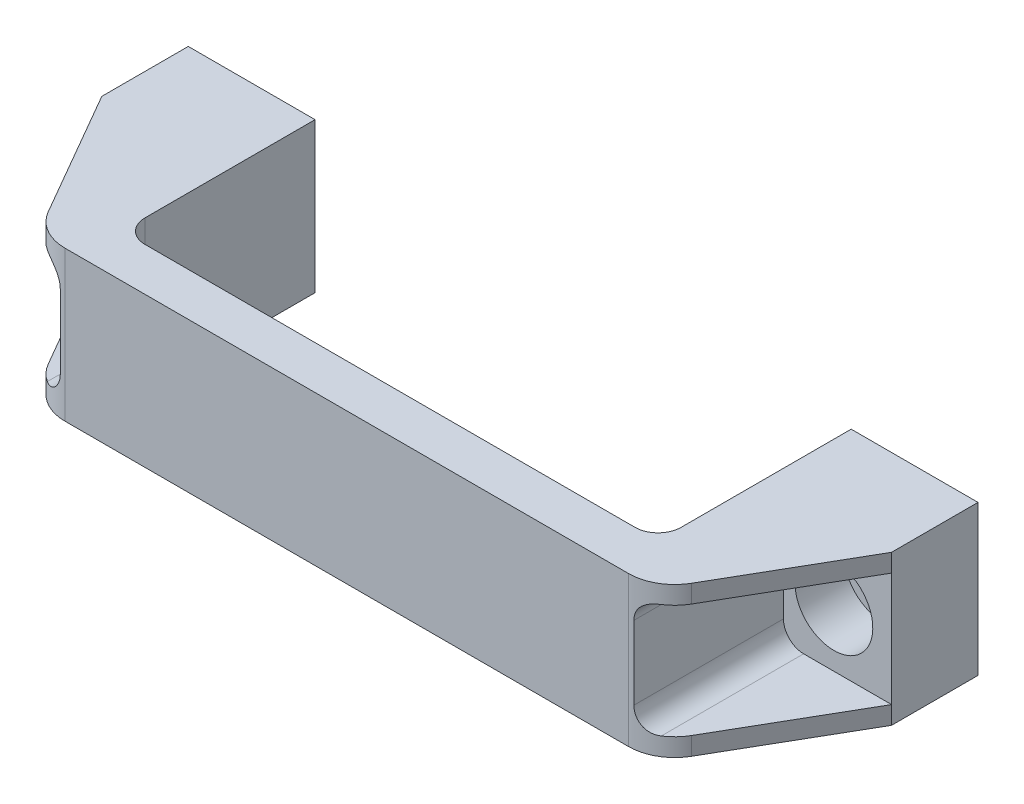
ISO-10303-21;
HEADER;
FILE_DESCRIPTION(('STEP AP214'),'2;1');
FILE_NAME('part.step','',(''),(''),'','','');
FILE_SCHEMA(('AUTOMOTIVE_DESIGN { 1 0 10303 214 1 1 1 1 }'));
ENDSEC;
DATA;
#1=APPLICATION_CONTEXT('core data for automotive mechanical design processes');
#2=APPLICATION_PROTOCOL_DEFINITION('international standard','automotive_design',2000,#1);
#3=PRODUCT_CONTEXT('',#1,'mechanical');
#4=PRODUCT('Part','Part','',(#3));
#5=PRODUCT_RELATED_PRODUCT_CATEGORY('part','',(#4));
#6=PRODUCT_DEFINITION_FORMATION('','',#4);
#7=PRODUCT_DEFINITION_CONTEXT('part definition',#1,'design');
#8=PRODUCT_DEFINITION('design','',#6,#7);
#9=PRODUCT_DEFINITION_SHAPE('','',#8);
#10=(LENGTH_UNIT() NAMED_UNIT(*) SI_UNIT(.MILLI.,.METRE.));
#11=(NAMED_UNIT(*) PLANE_ANGLE_UNIT() SI_UNIT($,.RADIAN.));
#12=(NAMED_UNIT(*) SI_UNIT($,.STERADIAN.) SOLID_ANGLE_UNIT());
#13=UNCERTAINTY_MEASURE_WITH_UNIT(LENGTH_MEASURE(1.E-05),#10,'distance_accuracy_value','');
#14=(GEOMETRIC_REPRESENTATION_CONTEXT(3) GLOBAL_UNCERTAINTY_ASSIGNED_CONTEXT((#13)) GLOBAL_UNIT_ASSIGNED_CONTEXT((#10,
#11,#12)) REPRESENTATION_CONTEXT('',''));
#15=CARTESIAN_POINT('',(0.,0.,0.));
#16=DIRECTION('',(0.,0.,1.));
#17=DIRECTION('',(1.,0.,0.));
#18=AXIS2_PLACEMENT_3D('',#15,#16,#17);
#19=CARTESIAN_POINT('',(0.,5.5,6.5));
#20=DIRECTION('',(0.,0.,-1.));
#21=DIRECTION('',(0.,1.,0.));
#22=AXIS2_PLACEMENT_3D('',#19,#20,#21);
#23=PLANE('',#22);
#24=CARTESIAN_POINT('',(0.,0.,6.5));
#25=DIRECTION('',(0.,0.,-1.));
#26=DIRECTION('',(0.,1.,0.));
#27=AXIS2_PLACEMENT_3D('',#24,#25,#26);
#28=CIRCLE('',#27,4.25);
#29=CARTESIAN_POINT('',(0.,4.25,6.5));
#30=VERTEX_POINT('',#29);
#31=EDGE_CURVE('E430',#30,#30,#28,.T.);
#32=ORIENTED_EDGE('',*,*,#31,.T.);
#33=EDGE_LOOP('',(#32));
#34=FACE_BOUND('',#33,.T.);
#35=CARTESIAN_POINT('',(0.,0.,6.5));
#36=DIRECTION('',(0.,0.,-1.));
#37=DIRECTION('',(0.,1.,0.));
#38=AXIS2_PLACEMENT_3D('',#35,#36,#37);
#39=CIRCLE('',#38,6.75);
#40=CARTESIAN_POINT('',(0.,6.75,6.5));
#41=VERTEX_POINT('',#40);
#42=EDGE_CURVE('E17',#41,#41,#39,.F.);
#43=ORIENTED_EDGE('',*,*,#42,.T.);
#44=EDGE_LOOP('',(#43));
#45=FACE_BOUND('',#44,.T.);
#46=ADVANCED_FACE('F14',(#34,#45),#23,.F.);
#47=CARTESIAN_POINT('',(117.,5.5,6.5));
#48=DIRECTION('',(0.,0.,-1.));
#49=DIRECTION('',(0.,1.,0.));
#50=AXIS2_PLACEMENT_3D('',#47,#48,#49);
#51=PLANE('',#50);
#52=CARTESIAN_POINT('',(117.,0.,6.5));
#53=DIRECTION('',(0.,0.,-1.));
#54=DIRECTION('',(0.,1.,0.));
#55=AXIS2_PLACEMENT_3D('',#52,#53,#54);
#56=CIRCLE('',#55,4.25);
#57=CARTESIAN_POINT('',(117.,4.25,6.5));
#58=VERTEX_POINT('',#57);
#59=EDGE_CURVE('E423',#58,#58,#56,.T.);
#60=ORIENTED_EDGE('',*,*,#59,.T.);
#61=EDGE_LOOP('',(#60));
#62=FACE_BOUND('',#61,.T.);
#63=CARTESIAN_POINT('',(117.,0.,6.5));
#64=DIRECTION('',(0.,0.,-1.));
#65=DIRECTION('',(0.,1.,0.));
#66=AXIS2_PLACEMENT_3D('',#63,#64,#65);
#67=CIRCLE('',#66,6.75);
#68=CARTESIAN_POINT('',(117.,6.75,6.5));
#69=VERTEX_POINT('',#68);
#70=EDGE_CURVE('E432',#69,#69,#67,.F.);
#71=ORIENTED_EDGE('',*,*,#70,.T.);
#72=EDGE_LOOP('',(#71));
#73=FACE_BOUND('',#72,.T.);
#74=ADVANCED_FACE('F443',(#62,#73),#51,.F.);
#75=CARTESIAN_POINT('',(0.,0.,10.75));
#76=DIRECTION('',(0.,0.,-1.));
#77=DIRECTION('',(0.,1.,0.));
#78=AXIS2_PLACEMENT_3D('',#75,#76,#77);
#79=CYLINDRICAL_SURFACE('',#78,6.75);
#80=CARTESIAN_POINT('',(0.,0.,15.));
#81=DIRECTION('',(0.,0.,-1.));
#82=DIRECTION('',(0.,1.,0.));
#83=AXIS2_PLACEMENT_3D('',#80,#81,#82);
#84=CIRCLE('',#83,6.75);
#85=CARTESIAN_POINT('',(0.,6.75,15.));
#86=VERTEX_POINT('',#85);
#87=EDGE_CURVE('E418',#86,#86,#84,.T.);
#88=ORIENTED_EDGE('',*,*,#87,.F.);
#89=EDGE_LOOP('',(#88));
#90=FACE_BOUND('',#89,.T.);
#91=ORIENTED_EDGE('',*,*,#42,.F.);
#92=EDGE_LOOP('',(#91));
#93=FACE_BOUND('',#92,.T.);
#94=ADVANCED_FACE('F440',(#90,#93),#79,.F.);
#95=CARTESIAN_POINT('',(117.,0.,10.75));
#96=DIRECTION('',(0.,0.,-1.));
#97=DIRECTION('',(0.,1.,0.));
#98=AXIS2_PLACEMENT_3D('',#95,#96,#97);
#99=CYLINDRICAL_SURFACE('',#98,6.75);
#100=CARTESIAN_POINT('',(117.,0.,15.));
#101=DIRECTION('',(0.,0.,-1.));
#102=DIRECTION('',(0.,1.,0.));
#103=AXIS2_PLACEMENT_3D('',#100,#101,#102);
#104=CIRCLE('',#103,6.75);
#105=CARTESIAN_POINT('',(117.,6.75,15.));
#106=VERTEX_POINT('',#105);
#107=EDGE_CURVE('E416',#106,#106,#104,.T.);
#108=ORIENTED_EDGE('',*,*,#107,.F.);
#109=EDGE_LOOP('',(#108));
#110=FACE_BOUND('',#109,.T.);
#111=ORIENTED_EDGE('',*,*,#70,.F.);
#112=EDGE_LOOP('',(#111));
#113=FACE_BOUND('',#112,.T.);
#114=ADVANCED_FACE('F442',(#110,#113),#99,.F.);
#115=CARTESIAN_POINT('',(0.,0.,3.25));
#116=DIRECTION('',(0.,0.,-1.));
#117=DIRECTION('',(0.,1.,0.));
#118=AXIS2_PLACEMENT_3D('',#115,#116,#117);
#119=CYLINDRICAL_SURFACE('',#118,4.25);
#120=CARTESIAN_POINT('',(0.,0.,0.));
#121=DIRECTION('',(0.,0.,-1.));
#122=DIRECTION('',(0.,1.,0.));
#123=AXIS2_PLACEMENT_3D('',#120,#121,#122);
#124=CIRCLE('',#123,4.25);
#125=CARTESIAN_POINT('',(0.,4.25,0.));
#126=VERTEX_POINT('',#125);
#127=EDGE_CURVE('E373',#126,#126,#124,.F.);
#128=ORIENTED_EDGE('',*,*,#127,.F.);
#129=EDGE_LOOP('',(#128));
#130=FACE_BOUND('',#129,.T.);
#131=ORIENTED_EDGE('',*,*,#31,.F.);
#132=EDGE_LOOP('',(#131));
#133=FACE_BOUND('',#132,.T.);
#134=ADVANCED_FACE('F450',(#130,#133),#119,.F.);
#135=CARTESIAN_POINT('',(117.,0.,3.25));
#136=DIRECTION('',(0.,0.,-1.));
#137=DIRECTION('',(0.,1.,0.));
#138=AXIS2_PLACEMENT_3D('',#135,#136,#137);
#139=CYLINDRICAL_SURFACE('',#138,4.25);
#140=CARTESIAN_POINT('',(117.,0.,0.));
#141=DIRECTION('',(0.,0.,-1.));
#142=DIRECTION('',(0.,1.,0.));
#143=AXIS2_PLACEMENT_3D('',#140,#141,#142);
#144=CIRCLE('',#143,4.25);
#145=CARTESIAN_POINT('',(117.,4.25,0.));
#146=VERTEX_POINT('',#145);
#147=EDGE_CURVE('E359',#146,#146,#144,.F.);
#148=ORIENTED_EDGE('',*,*,#147,.F.);
#149=EDGE_LOOP('',(#148));
#150=FACE_BOUND('',#149,.T.);
#151=ORIENTED_EDGE('',*,*,#59,.F.);
#152=EDGE_LOOP('',(#151));
#153=FACE_BOUND('',#152,.T.);
#154=ADVANCED_FACE('F458',(#150,#153),#139,.F.);
#155=CARTESIAN_POINT('',(58.5,0.,15.));
#156=DIRECTION('',(0.,0.,1.));
#157=DIRECTION('',(0.,-1.,0.));
#158=AXIS2_PLACEMENT_3D('',#155,#156,#157);
#159=PLANE('',#158);
#160=CARTESIAN_POINT('',(5.25,6.375,15.));
#161=DIRECTION('',(0.,0.,-1.));
#162=DIRECTION('',(0.,1.,0.));
#163=AXIS2_PLACEMENT_3D('',#160,#161,#162);
#164=CIRCLE('',#163,3.5);
#165=CARTESIAN_POINT('',(8.75,6.375,15.));
#166=VERTEX_POINT('',#165);
#167=CARTESIAN_POINT('',(5.25,9.875,15.));
#168=VERTEX_POINT('',#167);
#169=EDGE_CURVE('E142',#166,#168,#164,.F.);
#170=ORIENTED_EDGE('',*,*,#169,.T.);
#171=DIRECTION('',(-1.,0.,0.));
#172=VECTOR('',#171,1.);
#173=CARTESIAN_POINT('',(-12.,9.875,15.));
#174=LINE('',#173,#172);
#175=CARTESIAN_POINT('',(-10.,9.875,15.));
#176=VERTEX_POINT('',#175);
#177=EDGE_CURVE('E146',#168,#176,#174,.T.);
#178=ORIENTED_EDGE('',*,*,#177,.T.);
#179=DIRECTION('',(0.,-1.,0.));
#180=VECTOR('',#179,1.);
#181=CARTESIAN_POINT('',(-10.,-13.,15.));
#182=LINE('',#181,#180);
#183=CARTESIAN_POINT('',(-10.,-9.875,15.));
#184=VERTEX_POINT('',#183);
#185=EDGE_CURVE('E338',#184,#176,#182,.F.);
#186=ORIENTED_EDGE('',*,*,#185,.F.);
#187=DIRECTION('',(1.,0.,0.));
#188=VECTOR('',#187,1.);
#189=CARTESIAN_POINT('',(5.25,-9.875,15.));
#190=LINE('',#189,#188);
#191=CARTESIAN_POINT('',(5.25,-9.875,15.));
#192=VERTEX_POINT('',#191);
#193=EDGE_CURVE('E415',#184,#192,#190,.T.);
#194=ORIENTED_EDGE('',*,*,#193,.T.);
#195=CARTESIAN_POINT('',(5.25,-6.375,15.));
#196=DIRECTION('',(0.,0.,-1.));
#197=DIRECTION('',(0.,1.,0.));
#198=AXIS2_PLACEMENT_3D('',#195,#196,#197);
#199=CIRCLE('',#198,3.5);
#200=CARTESIAN_POINT('',(8.75,-6.375,15.));
#201=VERTEX_POINT('',#200);
#202=EDGE_CURVE('E380',#192,#201,#199,.F.);
#203=ORIENTED_EDGE('',*,*,#202,.T.);
#204=DIRECTION('',(0.,1.,0.));
#205=VECTOR('',#204,1.);
#206=CARTESIAN_POINT('',(8.75,6.375,15.));
#207=LINE('',#206,#205);
#208=EDGE_CURVE('E138',#201,#166,#207,.T.);
#209=ORIENTED_EDGE('',*,*,#208,.T.);
#210=EDGE_LOOP('',(#170,#178,#186,#194,#203,#209));
#211=FACE_BOUND('',#210,.T.);
#212=ORIENTED_EDGE('',*,*,#87,.T.);
#213=EDGE_LOOP('',(#212));
#214=FACE_BOUND('',#213,.T.);
#215=ADVANCED_FACE('F462',(#211,#214),#159,.T.);
#216=CARTESIAN_POINT('',(58.5,0.,15.));
#217=DIRECTION('',(0.,0.,1.));
#218=DIRECTION('',(0.,-1.,0.));
#219=AXIS2_PLACEMENT_3D('',#216,#217,#218);
#220=PLANE('',#219);
#221=CARTESIAN_POINT('',(111.75,-6.375,15.));
#222=DIRECTION('',(0.,0.,-1.));
#223=DIRECTION('',(0.,1.,0.));
#224=AXIS2_PLACEMENT_3D('',#221,#222,#223);
#225=CIRCLE('',#224,3.5);
#226=CARTESIAN_POINT('',(108.25,-6.375,15.));
#227=VERTEX_POINT('',#226);
#228=CARTESIAN_POINT('',(111.75,-9.875,15.));
#229=VERTEX_POINT('',#228);
#230=EDGE_CURVE('E180',#227,#229,#225,.F.);
#231=ORIENTED_EDGE('',*,*,#230,.T.);
#232=DIRECTION('',(1.,0.,0.));
#233=VECTOR('',#232,1.);
#234=CARTESIAN_POINT('',(129.,-9.875,15.));
#235=LINE('',#234,#233);
#236=CARTESIAN_POINT('',(127.,-9.875,15.));
#237=VERTEX_POINT('',#236);
#238=EDGE_CURVE('E176',#229,#237,#235,.T.);
#239=ORIENTED_EDGE('',*,*,#238,.T.);
#240=DIRECTION('',(0.,1.,0.));
#241=VECTOR('',#240,1.);
#242=CARTESIAN_POINT('',(127.,-13.,15.));
#243=LINE('',#242,#241);
#244=CARTESIAN_POINT('',(127.,9.875,15.));
#245=VERTEX_POINT('',#244);
#246=EDGE_CURVE('E353',#245,#237,#243,.F.);
#247=ORIENTED_EDGE('',*,*,#246,.F.);
#248=DIRECTION('',(-1.,0.,0.));
#249=VECTOR('',#248,1.);
#250=CARTESIAN_POINT('',(111.75,9.875,15.));
#251=LINE('',#250,#249);
#252=CARTESIAN_POINT('',(111.75,9.875,15.));
#253=VERTEX_POINT('',#252);
#254=EDGE_CURVE('E332',#245,#253,#251,.T.);
#255=ORIENTED_EDGE('',*,*,#254,.T.);
#256=CARTESIAN_POINT('',(111.75,6.375,15.));
#257=DIRECTION('',(0.,0.,-1.));
#258=DIRECTION('',(0.,1.,0.));
#259=AXIS2_PLACEMENT_3D('',#256,#257,#258);
#260=CIRCLE('',#259,3.5);
#261=CARTESIAN_POINT('',(108.25,6.375,15.));
#262=VERTEX_POINT('',#261);
#263=EDGE_CURVE('E320',#253,#262,#260,.F.);
#264=ORIENTED_EDGE('',*,*,#263,.T.);
#265=DIRECTION('',(0.,-1.,0.));
#266=VECTOR('',#265,1.);
#267=CARTESIAN_POINT('',(108.25,-6.375,15.));
#268=LINE('',#267,#266);
#269=EDGE_CURVE('E179',#262,#227,#268,.T.);
#270=ORIENTED_EDGE('',*,*,#269,.T.);
#271=EDGE_LOOP('',(#231,#239,#247,#255,#264,#270));
#272=FACE_BOUND('',#271,.T.);
#273=ORIENTED_EDGE('',*,*,#107,.T.);
#274=EDGE_LOOP('',(#273));
#275=FACE_BOUND('',#274,.T.);
#276=ADVANCED_FACE('F466',(#272,#275),#220,.T.);
#277=CARTESIAN_POINT('',(5.25,-9.875,15.));
#278=DIRECTION('',(0.,-1.,0.));
#279=DIRECTION('',(1.,0.,0.));
#280=AXIS2_PLACEMENT_3D('',#277,#278,#279);
#281=PLANE('',#280);
#282=DIRECTION('',(0.,0.,-1.));
#283=VECTOR('',#282,1.);
#284=CARTESIAN_POINT('',(5.25,-9.875,15.));
#285=LINE('',#284,#283);
#286=CARTESIAN_POINT('',(5.25,-9.875,39.6945048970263));
#287=VERTEX_POINT('',#286);
#288=EDGE_CURVE('E381',#287,#192,#285,.T.);
#289=ORIENTED_EDGE('',*,*,#288,.T.);
#290=ORIENTED_EDGE('',*,*,#193,.F.);
#291=DIRECTION('',(-0.5,0.,-0.866025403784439));
#292=VECTOR('',#291,1.);
#293=CARTESIAN_POINT('',(2.7017059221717,-9.875,37.));
#294=LINE('',#293,#292);
#295=CARTESIAN_POINT('',(2.70170592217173,-9.875,37.));
#296=VERTEX_POINT('',#295);
#297=EDGE_CURVE('E352',#296,#184,#294,.T.);
#298=ORIENTED_EDGE('',*,*,#297,.F.);
#299=CARTESIAN_POINT('',(9.6299091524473,-9.875,33.));
#300=DIRECTION('',(0.,-1.,0.));
#301=DIRECTION('',(1.,0.,0.));
#302=AXIS2_PLACEMENT_3D('',#299,#300,#301);
#303=CIRCLE('',#302,8.);
#304=EDGE_CURVE('E301',#287,#296,#303,.T.);
#305=ORIENTED_EDGE('',*,*,#304,.F.);
#306=EDGE_LOOP('',(#289,#290,#298,#305));
#307=FACE_BOUND('',#306,.T.);
#308=ADVANCED_FACE('F469',(#307),#281,.F.);
#309=CARTESIAN_POINT('',(2.7017059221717,-13.,37.));
#310=DIRECTION('',(-0.866025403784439,0.,0.5));
#311=DIRECTION('',(-0.5,0.,-0.866025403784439));
#312=AXIS2_PLACEMENT_3D('',#309,#310,#311);
#313=PLANE('',#312);
#314=DIRECTION('',(-0.5,0.,-0.86602540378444));
#315=VECTOR('',#314,1.);
#316=CARTESIAN_POINT('',(2.7017059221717,13.,37.));
#317=LINE('',#316,#315);
#318=CARTESIAN_POINT('',(2.70170592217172,13.,37.));
#319=VERTEX_POINT('',#318);
#320=CARTESIAN_POINT('',(-10.,13.,15.));
#321=VERTEX_POINT('',#320);
#322=EDGE_CURVE('E303',#319,#321,#317,.T.);
#323=ORIENTED_EDGE('',*,*,#322,.T.);
#324=DIRECTION('',(0.,-1.,0.));
#325=VECTOR('',#324,1.);
#326=CARTESIAN_POINT('',(-10.,-13.,15.));
#327=LINE('',#326,#325);
#328=EDGE_CURVE('E400',#176,#321,#327,.F.);
#329=ORIENTED_EDGE('',*,*,#328,.F.);
#330=DIRECTION('',(0.5,0.,0.86602540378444));
#331=VECTOR('',#330,1.);
#332=CARTESIAN_POINT('',(-10.,9.875,15.));
#333=LINE('',#332,#331);
#334=CARTESIAN_POINT('',(2.70170592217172,9.875,37.));
#335=VERTEX_POINT('',#334);
#336=EDGE_CURVE('E388',#176,#335,#333,.T.);
#337=ORIENTED_EDGE('',*,*,#336,.T.);
#338=DIRECTION('',(0.,-1.,0.));
#339=VECTOR('',#338,1.);
#340=CARTESIAN_POINT('',(2.70170592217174,-13.,37.));
#341=LINE('',#340,#339);
#342=EDGE_CURVE('E390',#319,#335,#341,.T.);
#343=ORIENTED_EDGE('',*,*,#342,.F.);
#344=EDGE_LOOP('',(#323,#329,#337,#343));
#345=FACE_BOUND('',#344,.T.);
#346=ADVANCED_FACE('F473',(#345),#313,.T.);
#347=CARTESIAN_POINT('',(-12.,9.875,15.));
#348=DIRECTION('',(0.,1.,0.));
#349=DIRECTION('',(-1.,0.,0.));
#350=AXIS2_PLACEMENT_3D('',#347,#348,#349);
#351=PLANE('',#350);
#352=ORIENTED_EDGE('',*,*,#177,.F.);
#353=DIRECTION('',(0.,0.,-1.));
#354=VECTOR('',#353,1.);
#355=CARTESIAN_POINT('',(5.25,9.875,15.));
#356=LINE('',#355,#354);
#357=CARTESIAN_POINT('',(5.25,9.875,39.6945048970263));
#358=VERTEX_POINT('',#357);
#359=EDGE_CURVE('E386',#168,#358,#356,.F.);
#360=ORIENTED_EDGE('',*,*,#359,.T.);
#361=CARTESIAN_POINT('',(9.6299091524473,9.875,33.));
#362=DIRECTION('',(0.,-1.,0.));
#363=DIRECTION('',(1.,0.,0.));
#364=AXIS2_PLACEMENT_3D('',#361,#362,#363);
#365=CIRCLE('',#364,8.);
#366=EDGE_CURVE('E393',#335,#358,#365,.F.);
#367=ORIENTED_EDGE('',*,*,#366,.F.);
#368=ORIENTED_EDGE('',*,*,#336,.F.);
#369=EDGE_LOOP('',(#352,#360,#367,#368));
#370=FACE_BOUND('',#369,.T.);
#371=ADVANCED_FACE('F477',(#370),#351,.F.);
#372=CARTESIAN_POINT('',(5.25,6.375,15.));
#373=DIRECTION('',(0.,0.,-1.));
#374=DIRECTION('',(0.,1.,0.));
#375=AXIS2_PLACEMENT_3D('',#372,#373,#374);
#376=CYLINDRICAL_SURFACE('',#375,3.5);
#377=ORIENTED_EDGE('',*,*,#359,.F.);
#378=ORIENTED_EDGE('',*,*,#169,.F.);
#379=DIRECTION('',(0.,0.,1.));
#380=VECTOR('',#379,1.);
#381=CARTESIAN_POINT('',(8.75,6.375,15.));
#382=LINE('',#381,#380);
#383=CARTESIAN_POINT('',(8.75,6.375,40.9514627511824));
#384=VERTEX_POINT('',#383);
#385=EDGE_CURVE('E384',#166,#384,#382,.T.);
#386=ORIENTED_EDGE('',*,*,#385,.T.);
#387=CARTESIAN_POINT('',(5.25,9.875,39.6945048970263));
#388=CARTESIAN_POINT('',(5.33728505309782,9.87500834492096,39.7516304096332));
#389=CARTESIAN_POINT('',(5.42573221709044,9.87173436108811,39.8070407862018));
#390=CARTESIAN_POINT('',(5.60438573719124,9.85816355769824,39.9141848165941));
#391=CARTESIAN_POINT('',(5.69459339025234,9.84786135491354,39.9659156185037));
#392=CARTESIAN_POINT('',(5.8763497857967,9.81973076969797,40.0655204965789));
#393=CARTESIAN_POINT('',(5.96790183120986,9.80187903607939,40.1133820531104));
#394=CARTESIAN_POINT('',(6.15124747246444,9.75828656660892,40.2048177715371));
#395=CARTESIAN_POINT('',(6.24304100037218,9.73254785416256,40.2483930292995));
#396=CARTESIAN_POINT('',(6.42646466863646,9.67276922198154,40.3313113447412));
#397=CARTESIAN_POINT('',(6.51809152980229,9.6386872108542,40.3706314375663));
#398=CARTESIAN_POINT('',(6.69969555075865,9.56217578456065,40.4446936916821));
#399=CARTESIAN_POINT('',(6.78967281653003,9.51974690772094,40.4794361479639));
#400=CARTESIAN_POINT('',(6.96674762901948,9.42668157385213,40.5442988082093));
#401=CARTESIAN_POINT('',(7.05385084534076,9.37606260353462,40.5744285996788));
#402=CARTESIAN_POINT('',(7.22432519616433,9.26676233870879,40.6302825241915));
#403=CARTESIAN_POINT('',(7.30769670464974,9.20808185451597,40.6560070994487));
#404=CARTESIAN_POINT('',(7.46251037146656,9.08857602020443,40.7011881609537));
#405=CARTESIAN_POINT('',(7.53435450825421,9.02840353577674,40.7209983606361));
#406=CARTESIAN_POINT('',(7.67343392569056,8.9020142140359,40.757407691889));
#407=CARTESIAN_POINT('',(7.74066769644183,8.83579541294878,40.7740057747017));
#408=CARTESIAN_POINT('',(7.86987709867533,8.69775263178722,40.8042740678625));
#409=CARTESIAN_POINT('',(7.93185131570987,8.62592715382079,40.8179434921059));
#410=CARTESIAN_POINT('',(8.04996612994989,8.47719557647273,40.8426666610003));
#411=CARTESIAN_POINT('',(8.10610454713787,8.40028759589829,40.8537194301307));
#412=CARTESIAN_POINT('',(8.26328969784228,8.16528818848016,40.883122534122));
#413=CARTESIAN_POINT('',(8.35529291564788,8.0005821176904,40.8981997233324));
#414=CARTESIAN_POINT('',(8.51169369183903,7.65828046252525,40.9218621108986));
#415=CARTESIAN_POINT('',(8.57609912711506,7.48068857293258,40.9304491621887));
#416=CARTESIAN_POINT('',(8.66697782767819,7.1486648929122,40.9419431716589));
#417=CARTESIAN_POINT('',(8.69807580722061,6.99551731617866,40.9455740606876));
#418=CARTESIAN_POINT('',(8.72920837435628,6.76383229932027,40.9491405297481));
#419=CARTESIAN_POINT('',(8.73700015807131,6.68628679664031,40.9500160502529));
#420=CARTESIAN_POINT('',(8.74739656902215,6.53083455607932,40.9511750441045));
#421=CARTESIAN_POINT('',(8.7500005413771,6.45292777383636,40.9514584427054));
#422=CARTESIAN_POINT('',(8.75,6.375,40.9514627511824));
#423=B_SPLINE_CURVE_WITH_KNOTS('',3,(#387,#388,#389,#390,#391,#392,#393,#394,#395,#396,#397,
#398,#399,#400,#401,#402,#403,#404,#405,#406,#407,#408,#409,#410,#411,#412,#413,#414,#415,#416,
#417,#418,#419,#420,#421,#422),.UNSPECIFIED.,.F.,.F.,(4,2,2,2,2,2,2,2,2,2,2,2,2,2,2,2,2,4),(0.,
0.312928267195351,0.626096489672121,0.940240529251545,1.25430404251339,1.56998587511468,
1.88564735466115,2.20064354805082,2.51560810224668,2.80261182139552,3.08970908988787,
3.37688332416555,3.6641644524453,4.22913557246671,4.79394533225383,5.26140160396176,
5.49506957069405,5.72876703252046),.UNSPECIFIED.);
#424=EDGE_CURVE('E238',#358,#384,#423,.T.);
#425=ORIENTED_EDGE('',*,*,#424,.F.);
#426=EDGE_LOOP('',(#377,#378,#386,#425));
#427=FACE_BOUND('',#426,.T.);
#428=ADVANCED_FACE('F480',(#427),#376,.F.);
#429=CARTESIAN_POINT('',(8.75,6.375,15.));
#430=DIRECTION('',(1.,0.,0.));
#431=DIRECTION('',(0.,1.,0.));
#432=AXIS2_PLACEMENT_3D('',#429,#430,#431);
#433=PLANE('',#432);
#434=ORIENTED_EDGE('',*,*,#385,.F.);
#435=ORIENTED_EDGE('',*,*,#208,.F.);
#436=DIRECTION('',(0.,0.,-1.));
#437=VECTOR('',#436,1.);
#438=CARTESIAN_POINT('',(8.75,-6.375,15.));
#439=LINE('',#438,#437);
#440=CARTESIAN_POINT('',(8.75,-6.375,40.9514627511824));
#441=VERTEX_POINT('',#440);
#442=EDGE_CURVE('E378',#201,#441,#439,.F.);
#443=ORIENTED_EDGE('',*,*,#442,.T.);
#444=DIRECTION('',(0.,-1.,0.));
#445=VECTOR('',#444,1.);
#446=CARTESIAN_POINT('',(8.75,-13.,40.9514627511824));
#447=LINE('',#446,#445);
#448=EDGE_CURVE('E237',#384,#441,#447,.T.);
#449=ORIENTED_EDGE('',*,*,#448,.F.);
#450=EDGE_LOOP('',(#434,#435,#443,#449));
#451=FACE_BOUND('',#450,.T.);
#452=ADVANCED_FACE('F484',(#451),#433,.F.);
#453=CARTESIAN_POINT('',(5.25,-6.375,15.));
#454=DIRECTION('',(0.,0.,-1.));
#455=DIRECTION('',(0.,1.,0.));
#456=AXIS2_PLACEMENT_3D('',#453,#454,#455);
#457=CYLINDRICAL_SURFACE('',#456,3.5);
#458=ORIENTED_EDGE('',*,*,#442,.F.);
#459=ORIENTED_EDGE('',*,*,#202,.F.);
#460=ORIENTED_EDGE('',*,*,#288,.F.);
#461=CARTESIAN_POINT('',(8.75,-6.375,40.9514627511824));
#462=CARTESIAN_POINT('',(8.75000951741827,-6.47230552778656,40.9514506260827));
#463=CARTESIAN_POINT('',(8.74594214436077,-6.56960722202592,40.9510133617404));
#464=CARTESIAN_POINT('',(8.72972674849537,-6.76352526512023,40.9492008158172));
#465=CARTESIAN_POINT('',(8.71757880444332,-6.86014162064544,40.9478255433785));
#466=CARTESIAN_POINT('',(8.68527827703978,-7.05199611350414,40.9440495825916));
#467=CARTESIAN_POINT('',(8.66512712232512,-7.14723449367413,40.9416490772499));
#468=CARTESIAN_POINT('',(8.61699173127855,-7.33564284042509,40.9356524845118));
#469=CARTESIAN_POINT('',(8.58900764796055,-7.42881284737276,40.93205642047));
#470=CARTESIAN_POINT('',(8.49353149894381,-7.7043656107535,40.9191441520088));
#471=CARTESIAN_POINT('',(8.41451087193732,-7.8828186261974,40.90770345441));
#472=CARTESIAN_POINT('',(8.22838038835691,-8.22350182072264,40.8768362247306));
#473=CARTESIAN_POINT('',(8.12127883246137,-8.38573677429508,40.8574120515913));
#474=CARTESIAN_POINT('',(7.88404273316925,-8.68762301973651,40.8080995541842));
#475=CARTESIAN_POINT('',(7.75418312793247,-8.82750952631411,40.7783323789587));
#476=CARTESIAN_POINT('',(7.47558860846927,-9.08284504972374,40.7058119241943));
#477=CARTESIAN_POINT('',(7.3268656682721,-9.1983094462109,40.6630668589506));
#478=CARTESIAN_POINT('',(7.02013134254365,-9.39982115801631,40.5640209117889));
#479=CARTESIAN_POINT('',(6.86241921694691,-9.48649431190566,40.5080610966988));
#480=CARTESIAN_POINT('',(6.5403623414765,-9.63326700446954,40.3813687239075));
#481=CARTESIAN_POINT('',(6.37600862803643,-9.69332922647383,40.3106156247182));
#482=CARTESIAN_POINT('',(6.13007131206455,-9.7636104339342,40.1943946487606));
#483=CARTESIAN_POINT('',(6.04862668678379,-9.78367981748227,40.1542146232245));
#484=CARTESIAN_POINT('',(5.88612847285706,-9.81770527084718,40.0705331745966));
#485=CARTESIAN_POINT('',(5.80507495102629,-9.83166033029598,40.0270312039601));
#486=CARTESIAN_POINT('',(5.64415346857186,-9.85368143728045,39.9370185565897));
#487=CARTESIAN_POINT('',(5.564282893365,-9.8617633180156,39.8905163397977));
#488=CARTESIAN_POINT('',(5.40597323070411,-9.87242304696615,39.7946273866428));
#489=CARTESIAN_POINT('',(5.32753339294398,-9.87500386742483,39.7452422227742));
#490=CARTESIAN_POINT('',(5.25,-9.875,39.6945048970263));
#491=B_SPLINE_CURVE_WITH_KNOTS('',3,(#461,#462,#463,#464,#465,#466,#467,#468,#469,#470,#471,
#472,#473,#474,#475,#476,#477,#478,#479,#480,#481,#482,#483,#484,#485,#486,#487,#488,#489,#490),
.UNSPECIFIED.,.F.,.F.,(4,2,2,2,2,2,2,2,2,2,2,2,2,2,4),(0.,0.291823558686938,0.583644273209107,
0.875412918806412,1.16717586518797,1.75061907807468,2.33389002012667,2.91054732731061,
3.48684040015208,4.04963135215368,4.61320903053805,4.89202041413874,5.17087785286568,
5.44898071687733,5.72693328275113),.UNSPECIFIED.);
#492=EDGE_CURVE('E227',#441,#287,#491,.T.);
#493=ORIENTED_EDGE('',*,*,#492,.F.);
#494=EDGE_LOOP('',(#458,#459,#460,#493));
#495=FACE_BOUND('',#494,.T.);
#496=ADVANCED_FACE('F245',(#495),#457,.F.);
#497=CARTESIAN_POINT('',(-10.,-13.,0.));
#498=DIRECTION('',(0.,0.,-1.));
#499=DIRECTION('',(0.,1.,0.));
#500=AXIS2_PLACEMENT_3D('',#497,#498,#499);
#501=PLANE('',#500);
#502=DIRECTION('',(1.,0.,0.));
#503=VECTOR('',#502,1.);
#504=CARTESIAN_POINT('',(58.5,-13.,0.));
#505=LINE('',#504,#503);
#506=CARTESIAN_POINT('',(-10.,-13.,0.));
#507=VERTEX_POINT('',#506);
#508=CARTESIAN_POINT('',(12.,-13.,0.));
#509=VERTEX_POINT('',#508);
#510=EDGE_CURVE('E236',#507,#509,#505,.T.);
#511=ORIENTED_EDGE('',*,*,#510,.F.);
#512=DIRECTION('',(0.,-1.,0.));
#513=VECTOR('',#512,1.);
#514=CARTESIAN_POINT('',(-10.,-13.,0.));
#515=LINE('',#514,#513);
#516=CARTESIAN_POINT('',(-10.,13.,0.));
#517=VERTEX_POINT('',#516);
#518=EDGE_CURVE('E339',#517,#507,#515,.T.);
#519=ORIENTED_EDGE('',*,*,#518,.F.);
#520=DIRECTION('',(1.,0.,0.));
#521=VECTOR('',#520,1.);
#522=CARTESIAN_POINT('',(58.5,13.,0.));
#523=LINE('',#522,#521);
#524=CARTESIAN_POINT('',(12.,13.,0.));
#525=VERTEX_POINT('',#524);
#526=EDGE_CURVE('E302',#517,#525,#523,.T.);
#527=ORIENTED_EDGE('',*,*,#526,.T.);
#528=DIRECTION('',(0.,1.,0.));
#529=VECTOR('',#528,1.);
#530=CARTESIAN_POINT('',(12.,-13.,0.));
#531=LINE('',#530,#529);
#532=EDGE_CURVE('E370',#509,#525,#531,.T.);
#533=ORIENTED_EDGE('',*,*,#532,.F.);
#534=EDGE_LOOP('',(#511,#519,#527,#533));
#535=FACE_BOUND('',#534,.T.);
#536=ORIENTED_EDGE('',*,*,#127,.T.);
#537=EDGE_LOOP('',(#536));
#538=FACE_BOUND('',#537,.T.);
#539=ADVANCED_FACE('F491',(#535,#538),#501,.T.);
#540=CARTESIAN_POINT('',(12.,-13.,0.));
#541=DIRECTION('',(1.,0.,0.));
#542=DIRECTION('',(0.,1.,0.));
#543=AXIS2_PLACEMENT_3D('',#540,#541,#542);
#544=PLANE('',#543);
#545=DIRECTION('',(0.,0.,1.));
#546=VECTOR('',#545,1.);
#547=CARTESIAN_POINT('',(12.,-13.,0.));
#548=LINE('',#547,#546);
#549=CARTESIAN_POINT('',(12.,-13.,29.5));
#550=VERTEX_POINT('',#549);
#551=EDGE_CURVE('E226',#509,#550,#548,.T.);
#552=ORIENTED_EDGE('',*,*,#551,.F.);
#553=ORIENTED_EDGE('',*,*,#532,.T.);
#554=DIRECTION('',(0.,0.,1.));
#555=VECTOR('',#554,1.);
#556=CARTESIAN_POINT('',(12.,13.,0.));
#557=LINE('',#556,#555);
#558=CARTESIAN_POINT('',(12.,13.,29.5));
#559=VERTEX_POINT('',#558);
#560=EDGE_CURVE('E298',#525,#559,#557,.T.);
#561=ORIENTED_EDGE('',*,*,#560,.T.);
#562=DIRECTION('',(0.,-1.,0.));
#563=VECTOR('',#562,1.);
#564=CARTESIAN_POINT('',(12.,-13.,29.5));
#565=LINE('',#564,#563);
#566=EDGE_CURVE('E368',#559,#550,#565,.T.);
#567=ORIENTED_EDGE('',*,*,#566,.T.);
#568=EDGE_LOOP('',(#552,#553,#561,#567));
#569=FACE_BOUND('',#568,.T.);
#570=ADVANCED_FACE('F523',(#569),#544,.T.);
#571=CARTESIAN_POINT('',(16.,-13.,29.5));
#572=DIRECTION('',(0.,-1.,0.));
#573=DIRECTION('',(1.,0.,0.));
#574=AXIS2_PLACEMENT_3D('',#571,#572,#573);
#575=CYLINDRICAL_SURFACE('',#574,4.);
#576=DIRECTION('',(0.,1.,0.));
#577=VECTOR('',#576,1.);
#578=CARTESIAN_POINT('',(16.,-13.,33.5));
#579=LINE('',#578,#577);
#580=CARTESIAN_POINT('',(16.,-13.,33.5));
#581=VERTEX_POINT('',#580);
#582=CARTESIAN_POINT('',(16.,13.,33.5));
#583=VERTEX_POINT('',#582);
#584=EDGE_CURVE('E365',#581,#583,#579,.T.);
#585=ORIENTED_EDGE('',*,*,#584,.F.);
#586=CARTESIAN_POINT('',(16.,-13.,29.5));
#587=DIRECTION('',(0.,-1.,0.));
#588=DIRECTION('',(1.,0.,0.));
#589=AXIS2_PLACEMENT_3D('',#586,#587,#588);
#590=CIRCLE('',#589,4.);
#591=EDGE_CURVE('E223',#550,#581,#590,.F.);
#592=ORIENTED_EDGE('',*,*,#591,.F.);
#593=ORIENTED_EDGE('',*,*,#566,.F.);
#594=CARTESIAN_POINT('',(16.,13.,29.5));
#595=DIRECTION('',(0.,-1.,0.));
#596=DIRECTION('',(1.,0.,0.));
#597=AXIS2_PLACEMENT_3D('',#594,#595,#596);
#598=CIRCLE('',#597,4.);
#599=EDGE_CURVE('E317',#559,#583,#598,.F.);
#600=ORIENTED_EDGE('',*,*,#599,.T.);
#601=EDGE_LOOP('',(#585,#592,#593,#600));
#602=FACE_BOUND('',#601,.T.);
#603=ADVANCED_FACE('F596',(#602),#575,.F.);
#604=CARTESIAN_POINT('',(16.,-13.,33.5));
#605=DIRECTION('',(0.,0.,-1.));
#606=DIRECTION('',(0.,1.,0.));
#607=AXIS2_PLACEMENT_3D('',#604,#605,#606);
#608=PLANE('',#607);
#609=DIRECTION('',(1.,0.,0.));
#610=VECTOR('',#609,1.);
#611=CARTESIAN_POINT('',(58.5,-13.,33.5));
#612=LINE('',#611,#610);
#613=CARTESIAN_POINT('',(101.,-13.,33.5));
#614=VERTEX_POINT('',#613);
#615=EDGE_CURVE('E222',#581,#614,#612,.T.);
#616=ORIENTED_EDGE('',*,*,#615,.F.);
#617=ORIENTED_EDGE('',*,*,#584,.T.);
#618=DIRECTION('',(1.,0.,0.));
#619=VECTOR('',#618,1.);
#620=CARTESIAN_POINT('',(58.5,13.,33.5));
#621=LINE('',#620,#619);
#622=CARTESIAN_POINT('',(101.,13.,33.5));
#623=VERTEX_POINT('',#622);
#624=EDGE_CURVE('E315',#583,#623,#621,.T.);
#625=ORIENTED_EDGE('',*,*,#624,.T.);
#626=DIRECTION('',(0.,-1.,0.));
#627=VECTOR('',#626,1.);
#628=CARTESIAN_POINT('',(101.,-13.,33.5));
#629=LINE('',#628,#627);
#630=EDGE_CURVE('E363',#623,#614,#629,.T.);
#631=ORIENTED_EDGE('',*,*,#630,.T.);
#632=EDGE_LOOP('',(#616,#617,#625,#631));
#633=FACE_BOUND('',#632,.T.);
#634=ADVANCED_FACE('F544',(#633),#608,.T.);
#635=CARTESIAN_POINT('',(101.,-13.,29.5));
#636=DIRECTION('',(0.,-1.,0.));
#637=DIRECTION('',(1.,0.,0.));
#638=AXIS2_PLACEMENT_3D('',#635,#636,#637);
#639=CYLINDRICAL_SURFACE('',#638,4.);
#640=DIRECTION('',(0.,-1.,0.));
#641=VECTOR('',#640,1.);
#642=CARTESIAN_POINT('',(105.,-13.,29.5));
#643=LINE('',#642,#641);
#644=CARTESIAN_POINT('',(105.,-13.,29.5));
#645=VERTEX_POINT('',#644);
#646=CARTESIAN_POINT('',(105.,13.,29.5));
#647=VERTEX_POINT('',#646);
#648=EDGE_CURVE('E360',#645,#647,#643,.F.);
#649=ORIENTED_EDGE('',*,*,#648,.F.);
#650=CARTESIAN_POINT('',(101.,-13.,29.5));
#651=DIRECTION('',(0.,-1.,0.));
#652=DIRECTION('',(1.,0.,0.));
#653=AXIS2_PLACEMENT_3D('',#650,#651,#652);
#654=CIRCLE('',#653,4.);
#655=EDGE_CURVE('E218',#614,#645,#654,.F.);
#656=ORIENTED_EDGE('',*,*,#655,.F.);
#657=ORIENTED_EDGE('',*,*,#630,.F.);
#658=CARTESIAN_POINT('',(101.,13.,29.5));
#659=DIRECTION('',(0.,-1.,0.));
#660=DIRECTION('',(1.,0.,0.));
#661=AXIS2_PLACEMENT_3D('',#658,#659,#660);
#662=CIRCLE('',#661,4.);
#663=EDGE_CURVE('E314',#623,#647,#662,.F.);
#664=ORIENTED_EDGE('',*,*,#663,.T.);
#665=EDGE_LOOP('',(#649,#656,#657,#664));
#666=FACE_BOUND('',#665,.T.);
#667=ADVANCED_FACE('F549',(#666),#639,.F.);
#668=CARTESIAN_POINT('',(105.,-13.,29.5));
#669=DIRECTION('',(-1.,0.,0.));
#670=DIRECTION('',(0.,-1.,0.));
#671=AXIS2_PLACEMENT_3D('',#668,#669,#670);
#672=PLANE('',#671);
#673=DIRECTION('',(0.,0.,1.));
#674=VECTOR('',#673,1.);
#675=CARTESIAN_POINT('',(105.,-13.,0.));
#676=LINE('',#675,#674);
#677=CARTESIAN_POINT('',(105.,-13.,0.));
#678=VERTEX_POINT('',#677);
#679=EDGE_CURVE('E221',#645,#678,#676,.F.);
#680=ORIENTED_EDGE('',*,*,#679,.F.);
#681=ORIENTED_EDGE('',*,*,#648,.T.);
#682=DIRECTION('',(0.,0.,1.));
#683=VECTOR('',#682,1.);
#684=CARTESIAN_POINT('',(105.,13.,0.));
#685=LINE('',#684,#683);
#686=CARTESIAN_POINT('',(105.,13.,0.));
#687=VERTEX_POINT('',#686);
#688=EDGE_CURVE('E310',#647,#687,#685,.F.);
#689=ORIENTED_EDGE('',*,*,#688,.T.);
#690=DIRECTION('',(0.,1.,0.));
#691=VECTOR('',#690,1.);
#692=CARTESIAN_POINT('',(105.,-13.,0.));
#693=LINE('',#692,#691);
#694=EDGE_CURVE('E356',#678,#687,#693,.T.);
#695=ORIENTED_EDGE('',*,*,#694,.F.);
#696=EDGE_LOOP('',(#680,#681,#689,#695));
#697=FACE_BOUND('',#696,.T.);
#698=ADVANCED_FACE('F554',(#697),#672,.T.);
#699=CARTESIAN_POINT('',(105.,-13.,0.));
#700=DIRECTION('',(0.,0.,-1.));
#701=DIRECTION('',(0.,1.,0.));
#702=AXIS2_PLACEMENT_3D('',#699,#700,#701);
#703=PLANE('',#702);
#704=DIRECTION('',(1.,0.,0.));
#705=VECTOR('',#704,1.);
#706=CARTESIAN_POINT('',(58.5,-13.,0.));
#707=LINE('',#706,#705);
#708=CARTESIAN_POINT('',(127.,-13.,0.));
#709=VERTEX_POINT('',#708);
#710=EDGE_CURVE('E348',#678,#709,#707,.T.);
#711=ORIENTED_EDGE('',*,*,#710,.F.);
#712=ORIENTED_EDGE('',*,*,#694,.T.);
#713=DIRECTION('',(1.,0.,0.));
#714=VECTOR('',#713,1.);
#715=CARTESIAN_POINT('',(58.5,13.,0.));
#716=LINE('',#715,#714);
#717=CARTESIAN_POINT('',(127.,13.,0.));
#718=VERTEX_POINT('',#717);
#719=EDGE_CURVE('E313',#687,#718,#716,.T.);
#720=ORIENTED_EDGE('',*,*,#719,.T.);
#721=DIRECTION('',(0.,1.,0.));
#722=VECTOR('',#721,1.);
#723=CARTESIAN_POINT('',(127.,-13.,0.));
#724=LINE('',#723,#722);
#725=EDGE_CURVE('E349',#709,#718,#724,.T.);
#726=ORIENTED_EDGE('',*,*,#725,.F.);
#727=EDGE_LOOP('',(#711,#712,#720,#726));
#728=FACE_BOUND('',#727,.T.);
#729=ORIENTED_EDGE('',*,*,#147,.T.);
#730=EDGE_LOOP('',(#729));
#731=FACE_BOUND('',#730,.T.);
#732=ADVANCED_FACE('F599',(#728,#731),#703,.T.);
#733=CARTESIAN_POINT('',(127.,-13.,0.));
#734=DIRECTION('',(1.,0.,0.));
#735=DIRECTION('',(0.,1.,0.));
#736=AXIS2_PLACEMENT_3D('',#733,#734,#735);
#737=PLANE('',#736);
#738=DIRECTION('',(0.,0.,1.));
#739=VECTOR('',#738,1.);
#740=CARTESIAN_POINT('',(127.,-13.,0.));
#741=LINE('',#740,#739);
#742=CARTESIAN_POINT('',(127.,-13.,15.));
#743=VERTEX_POINT('',#742);
#744=EDGE_CURVE('E345',#709,#743,#741,.T.);
#745=ORIENTED_EDGE('',*,*,#744,.F.);
#746=ORIENTED_EDGE('',*,*,#725,.T.);
#747=DIRECTION('',(0.,0.,1.));
#748=VECTOR('',#747,1.);
#749=CARTESIAN_POINT('',(127.,13.,0.));
#750=LINE('',#749,#748);
#751=CARTESIAN_POINT('',(127.,13.,15.));
#752=VERTEX_POINT('',#751);
#753=EDGE_CURVE('E309',#718,#752,#750,.T.);
#754=ORIENTED_EDGE('',*,*,#753,.T.);
#755=DIRECTION('',(0.,-1.,0.));
#756=VECTOR('',#755,1.);
#757=CARTESIAN_POINT('',(127.,-13.,15.));
#758=LINE('',#757,#756);
#759=EDGE_CURVE('E331',#245,#752,#758,.F.);
#760=ORIENTED_EDGE('',*,*,#759,.F.);
#761=ORIENTED_EDGE('',*,*,#246,.T.);
#762=DIRECTION('',(0.,-1.,0.));
#763=VECTOR('',#762,1.);
#764=CARTESIAN_POINT('',(127.,-13.,15.));
#765=LINE('',#764,#763);
#766=EDGE_CURVE('E343',#743,#237,#765,.F.);
#767=ORIENTED_EDGE('',*,*,#766,.F.);
#768=EDGE_LOOP('',(#745,#746,#754,#760,#761,#767));
#769=FACE_BOUND('',#768,.T.);
#770=ADVANCED_FACE('F572',(#769),#737,.T.);
#771=CARTESIAN_POINT('',(2.7017059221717,-13.,37.));
#772=DIRECTION('',(-0.866025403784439,0.,0.5));
#773=DIRECTION('',(-0.5,0.,-0.866025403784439));
#774=AXIS2_PLACEMENT_3D('',#771,#772,#773);
#775=PLANE('',#774);
#776=DIRECTION('',(-0.5,0.,-0.86602540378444));
#777=VECTOR('',#776,1.);
#778=CARTESIAN_POINT('',(2.7017059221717,-13.,37.));
#779=LINE('',#778,#777);
#780=CARTESIAN_POINT('',(2.70170592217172,-13.,37.));
#781=VERTEX_POINT('',#780);
#782=CARTESIAN_POINT('',(-10.,-13.,15.));
#783=VERTEX_POINT('',#782);
#784=EDGE_CURVE('E216',#781,#783,#779,.T.);
#785=ORIENTED_EDGE('',*,*,#784,.F.);
#786=DIRECTION('',(0.,-1.,0.));
#787=VECTOR('',#786,1.);
#788=CARTESIAN_POINT('',(2.70170592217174,-13.,37.));
#789=LINE('',#788,#787);
#790=EDGE_CURVE('E340',#296,#781,#789,.T.);
#791=ORIENTED_EDGE('',*,*,#790,.F.);
#792=ORIENTED_EDGE('',*,*,#297,.T.);
#793=DIRECTION('',(0.,-1.,0.));
#794=VECTOR('',#793,1.);
#795=CARTESIAN_POINT('',(-10.,-13.,15.));
#796=LINE('',#795,#794);
#797=EDGE_CURVE('E335',#783,#184,#796,.F.);
#798=ORIENTED_EDGE('',*,*,#797,.F.);
#799=EDGE_LOOP('',(#785,#791,#792,#798));
#800=FACE_BOUND('',#799,.T.);
#801=ADVANCED_FACE('F581',(#800),#775,.T.);
#802=CARTESIAN_POINT('',(-10.,-13.,15.));
#803=DIRECTION('',(-1.,0.,0.));
#804=DIRECTION('',(0.,-1.,0.));
#805=AXIS2_PLACEMENT_3D('',#802,#803,#804);
#806=PLANE('',#805);
#807=ORIENTED_EDGE('',*,*,#185,.T.);
#808=ORIENTED_EDGE('',*,*,#328,.T.);
#809=DIRECTION('',(0.,0.,1.));
#810=VECTOR('',#809,1.);
#811=CARTESIAN_POINT('',(-10.,13.,0.));
#812=LINE('',#811,#810);
#813=EDGE_CURVE('E306',#321,#517,#812,.F.);
#814=ORIENTED_EDGE('',*,*,#813,.T.);
#815=ORIENTED_EDGE('',*,*,#518,.T.);
#816=DIRECTION('',(0.,0.,1.));
#817=VECTOR('',#816,1.);
#818=CARTESIAN_POINT('',(-10.,-13.,0.));
#819=LINE('',#818,#817);
#820=EDGE_CURVE('E212',#783,#507,#819,.F.);
#821=ORIENTED_EDGE('',*,*,#820,.F.);
#822=ORIENTED_EDGE('',*,*,#797,.T.);
#823=EDGE_LOOP('',(#807,#808,#814,#815,#821,#822));
#824=FACE_BOUND('',#823,.T.);
#825=ADVANCED_FACE('F508',(#824),#806,.T.);
#826=CARTESIAN_POINT('',(111.75,9.875,15.));
#827=DIRECTION('',(0.,1.,0.));
#828=DIRECTION('',(-1.,0.,0.));
#829=AXIS2_PLACEMENT_3D('',#826,#827,#828);
#830=PLANE('',#829);
#831=DIRECTION('',(0.,0.,-1.));
#832=VECTOR('',#831,1.);
#833=CARTESIAN_POINT('',(111.75,9.875,15.));
#834=LINE('',#833,#832);
#835=CARTESIAN_POINT('',(111.75,9.875,39.6945048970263));
#836=VERTEX_POINT('',#835);
#837=EDGE_CURVE('E321',#836,#253,#834,.T.);
#838=ORIENTED_EDGE('',*,*,#837,.T.);
#839=ORIENTED_EDGE('',*,*,#254,.F.);
#840=DIRECTION('',(-0.5,0.,0.866025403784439));
#841=VECTOR('',#840,1.);
#842=CARTESIAN_POINT('',(127.,9.875,15.));
#843=LINE('',#842,#841);
#844=CARTESIAN_POINT('',(114.298294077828,9.875,37.));
#845=VERTEX_POINT('',#844);
#846=EDGE_CURVE('E328',#845,#245,#843,.F.);
#847=ORIENTED_EDGE('',*,*,#846,.F.);
#848=CARTESIAN_POINT('',(107.370090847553,9.875,33.));
#849=DIRECTION('',(0.,-1.,0.));
#850=DIRECTION('',(1.,0.,0.));
#851=AXIS2_PLACEMENT_3D('',#848,#849,#850);
#852=CIRCLE('',#851,8.);
#853=EDGE_CURVE('E209',#836,#845,#852,.F.);
#854=ORIENTED_EDGE('',*,*,#853,.F.);
#855=EDGE_LOOP('',(#838,#839,#847,#854));
#856=FACE_BOUND('',#855,.T.);
#857=ADVANCED_FACE('F605',(#856),#830,.F.);
#858=CARTESIAN_POINT('',(127.,-13.,15.));
#859=DIRECTION('',(0.866025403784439,0.,0.5));
#860=DIRECTION('',(-0.5,0.,0.866025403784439));
#861=AXIS2_PLACEMENT_3D('',#858,#859,#860);
#862=PLANE('',#861);
#863=DIRECTION('',(-0.5,0.,0.866025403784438));
#864=VECTOR('',#863,1.);
#865=CARTESIAN_POINT('',(127.,13.,15.));
#866=LINE('',#865,#864);
#867=CARTESIAN_POINT('',(114.298294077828,13.,37.));
#868=VERTEX_POINT('',#867);
#869=EDGE_CURVE('E307',#752,#868,#866,.T.);
#870=ORIENTED_EDGE('',*,*,#869,.T.);
#871=DIRECTION('',(0.,-1.,0.));
#872=VECTOR('',#871,1.);
#873=CARTESIAN_POINT('',(114.298294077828,-13.,37.));
#874=LINE('',#873,#872);
#875=EDGE_CURVE('E208',#845,#868,#874,.F.);
#876=ORIENTED_EDGE('',*,*,#875,.F.);
#877=ORIENTED_EDGE('',*,*,#846,.T.);
#878=ORIENTED_EDGE('',*,*,#759,.T.);
#879=EDGE_LOOP('',(#870,#876,#877,#878));
#880=FACE_BOUND('',#879,.T.);
#881=ADVANCED_FACE('F602',(#880),#862,.T.);
#882=CARTESIAN_POINT('',(127.,-13.,15.));
#883=DIRECTION('',(0.866025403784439,0.,0.5));
#884=DIRECTION('',(-0.5,0.,0.866025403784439));
#885=AXIS2_PLACEMENT_3D('',#882,#883,#884);
#886=PLANE('',#885);
#887=DIRECTION('',(-0.5,0.,0.866025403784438));
#888=VECTOR('',#887,1.);
#889=CARTESIAN_POINT('',(127.,-13.,15.));
#890=LINE('',#889,#888);
#891=CARTESIAN_POINT('',(114.298294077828,-13.,37.));
#892=VERTEX_POINT('',#891);
#893=EDGE_CURVE('E217',#743,#892,#890,.T.);
#894=ORIENTED_EDGE('',*,*,#893,.F.);
#895=ORIENTED_EDGE('',*,*,#766,.T.);
#896=DIRECTION('',(-0.5,0.,0.866025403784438));
#897=VECTOR('',#896,1.);
#898=CARTESIAN_POINT('',(127.,-9.875,15.));
#899=LINE('',#898,#897);
#900=CARTESIAN_POINT('',(114.298294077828,-9.875,37.));
#901=VERTEX_POINT('',#900);
#902=EDGE_CURVE('E163',#237,#901,#899,.T.);
#903=ORIENTED_EDGE('',*,*,#902,.T.);
#904=DIRECTION('',(0.,-1.,0.));
#905=VECTOR('',#904,1.);
#906=CARTESIAN_POINT('',(114.298294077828,-13.,37.));
#907=LINE('',#906,#905);
#908=EDGE_CURVE('E193',#892,#901,#907,.F.);
#909=ORIENTED_EDGE('',*,*,#908,.F.);
#910=EDGE_LOOP('',(#894,#895,#903,#909));
#911=FACE_BOUND('',#910,.T.);
#912=ADVANCED_FACE('F574',(#911),#886,.T.);
#913=CARTESIAN_POINT('',(129.,-9.875,15.));
#914=DIRECTION('',(0.,-1.,0.));
#915=DIRECTION('',(1.,0.,0.));
#916=AXIS2_PLACEMENT_3D('',#913,#914,#915);
#917=PLANE('',#916);
#918=ORIENTED_EDGE('',*,*,#902,.F.);
#919=ORIENTED_EDGE('',*,*,#238,.F.);
#920=DIRECTION('',(0.,0.,-1.));
#921=VECTOR('',#920,1.);
#922=CARTESIAN_POINT('',(111.75,-9.875,15.));
#923=LINE('',#922,#921);
#924=CARTESIAN_POINT('',(111.75,-9.875,39.6945048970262));
#925=VERTEX_POINT('',#924);
#926=EDGE_CURVE('E169',#229,#925,#923,.F.);
#927=ORIENTED_EDGE('',*,*,#926,.T.);
#928=CARTESIAN_POINT('',(107.370090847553,-9.875,33.));
#929=DIRECTION('',(0.,-1.,0.));
#930=DIRECTION('',(1.,0.,0.));
#931=AXIS2_PLACEMENT_3D('',#928,#929,#930);
#932=CIRCLE('',#931,8.);
#933=EDGE_CURVE('E173',#901,#925,#932,.T.);
#934=ORIENTED_EDGE('',*,*,#933,.F.);
#935=EDGE_LOOP('',(#918,#919,#927,#934));
#936=FACE_BOUND('',#935,.T.);
#937=ADVANCED_FACE('F171',(#936),#917,.F.);
#938=CARTESIAN_POINT('',(111.75,-6.375,15.));
#939=DIRECTION('',(0.,0.,-1.));
#940=DIRECTION('',(0.,1.,0.));
#941=AXIS2_PLACEMENT_3D('',#938,#939,#940);
#942=CYLINDRICAL_SURFACE('',#941,3.5);
#943=ORIENTED_EDGE('',*,*,#926,.F.);
#944=ORIENTED_EDGE('',*,*,#230,.F.);
#945=DIRECTION('',(0.,0.,1.));
#946=VECTOR('',#945,1.);
#947=CARTESIAN_POINT('',(108.25,-6.375,15.));
#948=LINE('',#947,#946);
#949=CARTESIAN_POINT('',(108.25,-6.375,40.9514627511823));
#950=VERTEX_POINT('',#949);
#951=EDGE_CURVE('E186',#227,#950,#948,.T.);
#952=ORIENTED_EDGE('',*,*,#951,.T.);
#953=CARTESIAN_POINT('',(111.75,-9.875,39.6945048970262));
#954=CARTESIAN_POINT('',(111.662714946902,-9.87500834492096,39.7516304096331));
#955=CARTESIAN_POINT('',(111.57426778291,-9.8717343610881,39.8070407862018));
#956=CARTESIAN_POINT('',(111.395614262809,-9.85816355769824,39.914184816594));
#957=CARTESIAN_POINT('',(111.305406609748,-9.84786135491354,39.9659156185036));
#958=CARTESIAN_POINT('',(111.123650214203,-9.81973076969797,40.0655204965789));
#959=CARTESIAN_POINT('',(111.03209816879,-9.8018790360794,40.1133820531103));
#960=CARTESIAN_POINT('',(110.848752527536,-9.75828656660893,40.204817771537));
#961=CARTESIAN_POINT('',(110.756958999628,-9.73254785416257,40.2483930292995));
#962=CARTESIAN_POINT('',(110.573535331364,-9.67276922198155,40.3313113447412));
#963=CARTESIAN_POINT('',(110.481908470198,-9.63868721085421,40.3706314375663));
#964=CARTESIAN_POINT('',(110.300304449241,-9.56217578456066,40.4446936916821));
#965=CARTESIAN_POINT('',(110.21032718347,-9.51974690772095,40.4794361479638));
#966=CARTESIAN_POINT('',(110.033252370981,-9.42668157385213,40.5442988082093));
#967=CARTESIAN_POINT('',(109.946149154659,-9.37606260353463,40.5744285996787));
#968=CARTESIAN_POINT('',(109.775674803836,-9.26676233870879,40.6302825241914));
#969=CARTESIAN_POINT('',(109.69230329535,-9.20808185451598,40.6560070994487));
#970=CARTESIAN_POINT('',(109.537489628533,-9.08857602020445,40.7011881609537));
#971=CARTESIAN_POINT('',(109.465645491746,-9.02840353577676,40.7209983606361));
#972=CARTESIAN_POINT('',(109.326566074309,-8.90201421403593,40.7574076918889));
#973=CARTESIAN_POINT('',(109.259332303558,-8.83579541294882,40.7740057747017));
#974=CARTESIAN_POINT('',(109.130122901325,-8.69775263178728,40.8042740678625));
#975=CARTESIAN_POINT('',(109.06814868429,-8.62592715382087,40.8179434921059));
#976=CARTESIAN_POINT('',(108.95003387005,-8.47719557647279,40.8426666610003));
#977=CARTESIAN_POINT('',(108.893895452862,-8.40028759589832,40.8537194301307));
#978=CARTESIAN_POINT('',(108.736710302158,-8.16528818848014,40.883122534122));
#979=CARTESIAN_POINT('',(108.644707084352,-8.00058211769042,40.8981997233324));
#980=CARTESIAN_POINT('',(108.488306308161,-7.65828046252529,40.9218621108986));
#981=CARTESIAN_POINT('',(108.423900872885,-7.48068857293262,40.9304491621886));
#982=CARTESIAN_POINT('',(108.333022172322,-7.14866489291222,40.9419431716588));
#983=CARTESIAN_POINT('',(108.301924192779,-6.99551731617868,40.9455740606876));
#984=CARTESIAN_POINT('',(108.270791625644,-6.76383229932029,40.9491405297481));
#985=CARTESIAN_POINT('',(108.262999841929,-6.68628679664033,40.9500160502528));
#986=CARTESIAN_POINT('',(108.252603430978,-6.53083455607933,40.9511750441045));
#987=CARTESIAN_POINT('',(108.249999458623,-6.45292777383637,40.9514584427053));
#988=CARTESIAN_POINT('',(108.25,-6.375,40.9514627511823));
#989=B_SPLINE_CURVE_WITH_KNOTS('',3,(#953,#954,#955,#956,#957,#958,#959,#960,#961,#962,#963,
#964,#965,#966,#967,#968,#969,#970,#971,#972,#973,#974,#975,#976,#977,#978,#979,#980,#981,#982,
#983,#984,#985,#986,#987,#988),.UNSPECIFIED.,.F.,.F.,(4,2,2,2,2,2,2,2,2,2,2,2,2,2,2,2,2,4),(0.,
0.31292826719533,0.626096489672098,0.940240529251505,1.25430404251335,1.56998587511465,
1.88564735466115,2.20064354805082,2.51560810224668,2.80261182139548,3.0897090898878,
3.37688332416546,3.6641644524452,4.22913557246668,4.79394533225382,5.26140160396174,
5.49506957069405,5.72876703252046),.UNSPECIFIED.);
#990=EDGE_CURVE('E183',#925,#950,#989,.T.);
#991=ORIENTED_EDGE('',*,*,#990,.F.);
#992=EDGE_LOOP('',(#943,#944,#952,#991));
#993=FACE_BOUND('',#992,.T.);
#994=ADVANCED_FACE('F184',(#993),#942,.F.);
#995=CARTESIAN_POINT('',(108.25,-6.375,15.));
#996=DIRECTION('',(-1.,0.,0.));
#997=DIRECTION('',(0.,-1.,0.));
#998=AXIS2_PLACEMENT_3D('',#995,#996,#997);
#999=PLANE('',#998);
#1000=ORIENTED_EDGE('',*,*,#951,.F.);
#1001=ORIENTED_EDGE('',*,*,#269,.F.);
#1002=DIRECTION('',(0.,0.,-1.));
#1003=VECTOR('',#1002,1.);
#1004=CARTESIAN_POINT('',(108.25,6.375,15.));
#1005=LINE('',#1004,#1003);
#1006=CARTESIAN_POINT('',(108.25,6.375,40.9514627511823));
#1007=VERTEX_POINT('',#1006);
#1008=EDGE_CURVE('E318',#262,#1007,#1005,.F.);
#1009=ORIENTED_EDGE('',*,*,#1008,.T.);
#1010=DIRECTION('',(0.,-1.,0.));
#1011=VECTOR('',#1010,1.);
#1012=CARTESIAN_POINT('',(108.25,-13.,40.9514627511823));
#1013=LINE('',#1012,#1011);
#1014=EDGE_CURVE('E190',#950,#1007,#1013,.F.);
#1015=ORIENTED_EDGE('',*,*,#1014,.F.);
#1016=EDGE_LOOP('',(#1000,#1001,#1009,#1015));
#1017=FACE_BOUND('',#1016,.T.);
#1018=ADVANCED_FACE('F265',(#1017),#999,.F.);
#1019=CARTESIAN_POINT('',(111.75,6.375,15.));
#1020=DIRECTION('',(0.,0.,-1.));
#1021=DIRECTION('',(0.,1.,0.));
#1022=AXIS2_PLACEMENT_3D('',#1019,#1020,#1021);
#1023=CYLINDRICAL_SURFACE('',#1022,3.5);
#1024=ORIENTED_EDGE('',*,*,#1008,.F.);
#1025=ORIENTED_EDGE('',*,*,#263,.F.);
#1026=ORIENTED_EDGE('',*,*,#837,.F.);
#1027=CARTESIAN_POINT('',(108.25,6.375,40.9514627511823));
#1028=CARTESIAN_POINT('',(108.249990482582,6.47230552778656,40.9514506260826));
#1029=CARTESIAN_POINT('',(108.254057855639,6.56960722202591,40.9510133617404));
#1030=CARTESIAN_POINT('',(108.270273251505,6.76352526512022,40.9492008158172));
#1031=CARTESIAN_POINT('',(108.282421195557,6.86014162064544,40.9478255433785));
#1032=CARTESIAN_POINT('',(108.31472172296,7.05199611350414,40.9440495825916));
#1033=CARTESIAN_POINT('',(108.334872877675,7.14723449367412,40.9416490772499));
#1034=CARTESIAN_POINT('',(108.383008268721,7.33564284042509,40.9356524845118));
#1035=CARTESIAN_POINT('',(108.410992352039,7.42881284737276,40.93205642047));
#1036=CARTESIAN_POINT('',(108.506468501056,7.70436561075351,40.9191441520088));
#1037=CARTESIAN_POINT('',(108.585489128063,7.88281862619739,40.90770345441));
#1038=CARTESIAN_POINT('',(108.771619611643,8.22350182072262,40.8768362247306));
#1039=CARTESIAN_POINT('',(108.878721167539,8.38573677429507,40.8574120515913));
#1040=CARTESIAN_POINT('',(109.115957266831,8.68762301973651,40.8080995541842));
#1041=CARTESIAN_POINT('',(109.245816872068,8.82750952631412,40.7783323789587));
#1042=CARTESIAN_POINT('',(109.524411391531,9.08284504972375,40.7058119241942));
#1043=CARTESIAN_POINT('',(109.673134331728,9.1983094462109,40.6630668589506));
#1044=CARTESIAN_POINT('',(109.979868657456,9.3998211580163,40.5640209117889));
#1045=CARTESIAN_POINT('',(110.137580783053,9.48649431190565,40.5080610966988));
#1046=CARTESIAN_POINT('',(110.459637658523,9.63326700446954,40.3813687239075));
#1047=CARTESIAN_POINT('',(110.623991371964,9.69332922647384,40.3106156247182));
#1048=CARTESIAN_POINT('',(110.869928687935,9.7636104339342,40.1943946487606));
#1049=CARTESIAN_POINT('',(110.951373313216,9.78367981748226,40.1542146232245));
#1050=CARTESIAN_POINT('',(111.113871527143,9.81770527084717,40.0705331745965));
#1051=CARTESIAN_POINT('',(111.194925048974,9.83166033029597,40.0270312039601));
#1052=CARTESIAN_POINT('',(111.355846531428,9.85368143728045,39.9370185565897));
#1053=CARTESIAN_POINT('',(111.435717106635,9.8617633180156,39.8905163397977));
#1054=CARTESIAN_POINT('',(111.594026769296,9.87242304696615,39.7946273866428));
#1055=CARTESIAN_POINT('',(111.672466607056,9.87500386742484,39.7452422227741));
#1056=CARTESIAN_POINT('',(111.75,9.875,39.6945048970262));
#1057=B_SPLINE_CURVE_WITH_KNOTS('',3,(#1027,#1028,#1029,#1030,#1031,#1032,#1033,#1034,#1035,
#1036,#1037,#1038,#1039,#1040,#1041,#1042,#1043,#1044,#1045,#1046,#1047,#1048,#1049,#1050,#1051,
#1052,#1053,#1054,#1055,#1056),.UNSPECIFIED.,.F.,.F.,(4,2,2,2,2,2,2,2,2,2,2,2,2,2,4),(0.,
0.291823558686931,0.583644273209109,0.875412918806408,1.16717586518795,1.75061907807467,
2.33389002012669,2.91054732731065,3.48684040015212,4.04963135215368,4.613209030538,
4.89202041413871,5.17087785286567,5.44898071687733,5.72693328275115),.UNSPECIFIED.);
#1058=EDGE_CURVE('E267',#1007,#836,#1057,.T.);
#1059=ORIENTED_EDGE('',*,*,#1058,.F.);
#1060=EDGE_LOOP('',(#1024,#1025,#1026,#1059));
#1061=FACE_BOUND('',#1060,.T.);
#1062=ADVANCED_FACE('F260',(#1061),#1023,.F.);
#1063=CARTESIAN_POINT('',(58.5,13.,0.));
#1064=DIRECTION('',(0.,-1.,0.));
#1065=DIRECTION('',(1.,0.,0.));
#1066=AXIS2_PLACEMENT_3D('',#1063,#1064,#1065);
#1067=PLANE('',#1066);
#1068=ORIENTED_EDGE('',*,*,#526,.F.);
#1069=ORIENTED_EDGE('',*,*,#813,.F.);
#1070=ORIENTED_EDGE('',*,*,#322,.F.);
#1071=CARTESIAN_POINT('',(9.6299091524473,13.,33.));
#1072=DIRECTION('',(0.,-1.,0.));
#1073=DIRECTION('',(1.,0.,0.));
#1074=AXIS2_PLACEMENT_3D('',#1071,#1072,#1073);
#1075=CIRCLE('',#1074,8.);
#1076=CARTESIAN_POINT('',(9.6299091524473,13.,41.));
#1077=VERTEX_POINT('',#1076);
#1078=EDGE_CURVE('E342',#1077,#319,#1075,.T.);
#1079=ORIENTED_EDGE('',*,*,#1078,.F.);
#1080=DIRECTION('',(1.,0.,0.));
#1081=VECTOR('',#1080,1.);
#1082=CARTESIAN_POINT('',(58.5,13.,41.));
#1083=LINE('',#1082,#1081);
#1084=CARTESIAN_POINT('',(107.370090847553,13.,41.));
#1085=VERTEX_POINT('',#1084);
#1086=EDGE_CURVE('E274',#1085,#1077,#1083,.F.);
#1087=ORIENTED_EDGE('',*,*,#1086,.F.);
#1088=CARTESIAN_POINT('',(107.370090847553,13.,33.));
#1089=DIRECTION('',(0.,-1.,0.));
#1090=DIRECTION('',(1.,0.,0.));
#1091=AXIS2_PLACEMENT_3D('',#1088,#1089,#1090);
#1092=CIRCLE('',#1091,8.);
#1093=EDGE_CURVE('E205',#868,#1085,#1092,.T.);
#1094=ORIENTED_EDGE('',*,*,#1093,.F.);
#1095=ORIENTED_EDGE('',*,*,#869,.F.);
#1096=ORIENTED_EDGE('',*,*,#753,.F.);
#1097=ORIENTED_EDGE('',*,*,#719,.F.);
#1098=ORIENTED_EDGE('',*,*,#688,.F.);
#1099=ORIENTED_EDGE('',*,*,#663,.F.);
#1100=ORIENTED_EDGE('',*,*,#624,.F.);
#1101=ORIENTED_EDGE('',*,*,#599,.F.);
#1102=ORIENTED_EDGE('',*,*,#560,.F.);
#1103=EDGE_LOOP('',(#1068,#1069,#1070,#1079,#1087,#1094,#1095,#1096,#1097,#1098,#1099,#1100,
#1101,#1102));
#1104=FACE_BOUND('',#1103,.T.);
#1105=ADVANCED_FACE('F255',(#1104),#1067,.F.);
#1106=CARTESIAN_POINT('',(9.6299091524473,-13.,33.));
#1107=DIRECTION('',(0.,-1.,0.));
#1108=DIRECTION('',(1.,0.,0.));
#1109=AXIS2_PLACEMENT_3D('',#1106,#1107,#1108);
#1110=CYLINDRICAL_SURFACE('',#1109,8.);
#1111=ORIENTED_EDGE('',*,*,#448,.T.);
#1112=ORIENTED_EDGE('',*,*,#492,.T.);
#1113=ORIENTED_EDGE('',*,*,#304,.T.);
#1114=ORIENTED_EDGE('',*,*,#790,.T.);
#1115=CARTESIAN_POINT('',(9.6299091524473,-13.,33.));
#1116=DIRECTION('',(0.,-1.,0.));
#1117=DIRECTION('',(1.,0.,0.));
#1118=AXIS2_PLACEMENT_3D('',#1115,#1116,#1117);
#1119=CIRCLE('',#1118,8.);
#1120=CARTESIAN_POINT('',(9.6299091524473,-13.,41.));
#1121=VERTEX_POINT('',#1120);
#1122=EDGE_CURVE('E213',#1121,#781,#1119,.T.);
#1123=ORIENTED_EDGE('',*,*,#1122,.F.);
#1124=DIRECTION('',(0.,-1.,0.));
#1125=VECTOR('',#1124,1.);
#1126=CARTESIAN_POINT('',(9.6299091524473,-13.,41.));
#1127=LINE('',#1126,#1125);
#1128=EDGE_CURVE('E290',#1077,#1121,#1127,.T.);
#1129=ORIENTED_EDGE('',*,*,#1128,.F.);
#1130=ORIENTED_EDGE('',*,*,#1078,.T.);
#1131=ORIENTED_EDGE('',*,*,#342,.T.);
#1132=ORIENTED_EDGE('',*,*,#366,.T.);
#1133=ORIENTED_EDGE('',*,*,#424,.T.);
#1134=EDGE_LOOP('',(#1111,#1112,#1113,#1114,#1123,#1129,#1130,#1131,#1132,#1133));
#1135=FACE_BOUND('',#1134,.T.);
#1136=ADVANCED_FACE('F249',(#1135),#1110,.T.);
#1137=CARTESIAN_POINT('',(58.5,-13.,0.));
#1138=DIRECTION('',(0.,-1.,0.));
#1139=DIRECTION('',(1.,0.,0.));
#1140=AXIS2_PLACEMENT_3D('',#1137,#1138,#1139);
#1141=PLANE('',#1140);
#1142=ORIENTED_EDGE('',*,*,#784,.T.);
#1143=ORIENTED_EDGE('',*,*,#820,.T.);
#1144=ORIENTED_EDGE('',*,*,#510,.T.);
#1145=ORIENTED_EDGE('',*,*,#551,.T.);
#1146=ORIENTED_EDGE('',*,*,#591,.T.);
#1147=ORIENTED_EDGE('',*,*,#615,.T.);
#1148=ORIENTED_EDGE('',*,*,#655,.T.);
#1149=ORIENTED_EDGE('',*,*,#679,.T.);
#1150=ORIENTED_EDGE('',*,*,#710,.T.);
#1151=ORIENTED_EDGE('',*,*,#744,.T.);
#1152=ORIENTED_EDGE('',*,*,#893,.T.);
#1153=CARTESIAN_POINT('',(107.370090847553,-13.,33.));
#1154=DIRECTION('',(0.,-1.,0.));
#1155=DIRECTION('',(1.,0.,0.));
#1156=AXIS2_PLACEMENT_3D('',#1153,#1154,#1155);
#1157=CIRCLE('',#1156,8.);
#1158=CARTESIAN_POINT('',(107.370090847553,-13.,41.));
#1159=VERTEX_POINT('',#1158);
#1160=EDGE_CURVE('E32',#1159,#892,#1157,.F.);
#1161=ORIENTED_EDGE('',*,*,#1160,.F.);
#1162=DIRECTION('',(1.,0.,0.));
#1163=VECTOR('',#1162,1.);
#1164=CARTESIAN_POINT('',(58.5,-13.,41.));
#1165=LINE('',#1164,#1163);
#1166=EDGE_CURVE('E23',#1121,#1159,#1165,.T.);
#1167=ORIENTED_EDGE('',*,*,#1166,.F.);
#1168=ORIENTED_EDGE('',*,*,#1122,.T.);
#1169=EDGE_LOOP('',(#1142,#1143,#1144,#1145,#1146,#1147,#1148,#1149,#1150,#1151,#1152,#1161,
#1167,#1168));
#1170=FACE_BOUND('',#1169,.T.);
#1171=ADVANCED_FACE('F254',(#1170),#1141,.T.);
#1172=CARTESIAN_POINT('',(107.370090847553,-13.,33.));
#1173=DIRECTION('',(0.,-1.,0.));
#1174=DIRECTION('',(1.,0.,0.));
#1175=AXIS2_PLACEMENT_3D('',#1172,#1173,#1174);
#1176=CYLINDRICAL_SURFACE('',#1175,8.);
#1177=ORIENTED_EDGE('',*,*,#1014,.T.);
#1178=ORIENTED_EDGE('',*,*,#1058,.T.);
#1179=ORIENTED_EDGE('',*,*,#853,.T.);
#1180=ORIENTED_EDGE('',*,*,#875,.T.);
#1181=ORIENTED_EDGE('',*,*,#1093,.T.);
#1182=DIRECTION('',(0.,-1.,0.));
#1183=VECTOR('',#1182,1.);
#1184=CARTESIAN_POINT('',(107.370090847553,-13.,41.));
#1185=LINE('',#1184,#1183);
#1186=EDGE_CURVE('E9',#1159,#1085,#1185,.F.);
#1187=ORIENTED_EDGE('',*,*,#1186,.F.);
#1188=ORIENTED_EDGE('',*,*,#1160,.T.);
#1189=ORIENTED_EDGE('',*,*,#908,.T.);
#1190=ORIENTED_EDGE('',*,*,#933,.T.);
#1191=ORIENTED_EDGE('',*,*,#990,.T.);
#1192=EDGE_LOOP('',(#1177,#1178,#1179,#1180,#1181,#1187,#1188,#1189,#1190,#1191));
#1193=FACE_BOUND('',#1192,.T.);
#1194=ADVANCED_FACE('F192',(#1193),#1176,.T.);
#1195=CARTESIAN_POINT('',(58.5,-13.,41.));
#1196=DIRECTION('',(0.,0.,1.));
#1197=DIRECTION('',(0.,-1.,0.));
#1198=AXIS2_PLACEMENT_3D('',#1195,#1196,#1197);
#1199=PLANE('',#1198);
#1200=ORIENTED_EDGE('',*,*,#1166,.T.);
#1201=ORIENTED_EDGE('',*,*,#1186,.T.);
#1202=ORIENTED_EDGE('',*,*,#1086,.T.);
#1203=ORIENTED_EDGE('',*,*,#1128,.T.);
#1204=EDGE_LOOP('',(#1200,#1201,#1202,#1203));
#1205=FACE_BOUND('',#1204,.T.);
#1206=ADVANCED_FACE('F279',(#1205),#1199,.T.);
#1207=CLOSED_SHELL('',(#46,#74,#94,#114,#134,#154,#215,#276,#308,#346,#371,#428,#452,#496,#539,
#570,#603,#634,#667,#698,#732,#770,#801,#825,#857,#881,#912,#937,#994,#1018,#1062,#1105,#1136,
#1171,#1194,#1206));
#1208=MANIFOLD_SOLID_BREP('B1',#1207);
#1209=ADVANCED_BREP_SHAPE_REPRESENTATION('',(#18,#1208),#14);
#1210=SHAPE_DEFINITION_REPRESENTATION(#9,#1209);
ENDSEC;
END-ISO-10303-21;
